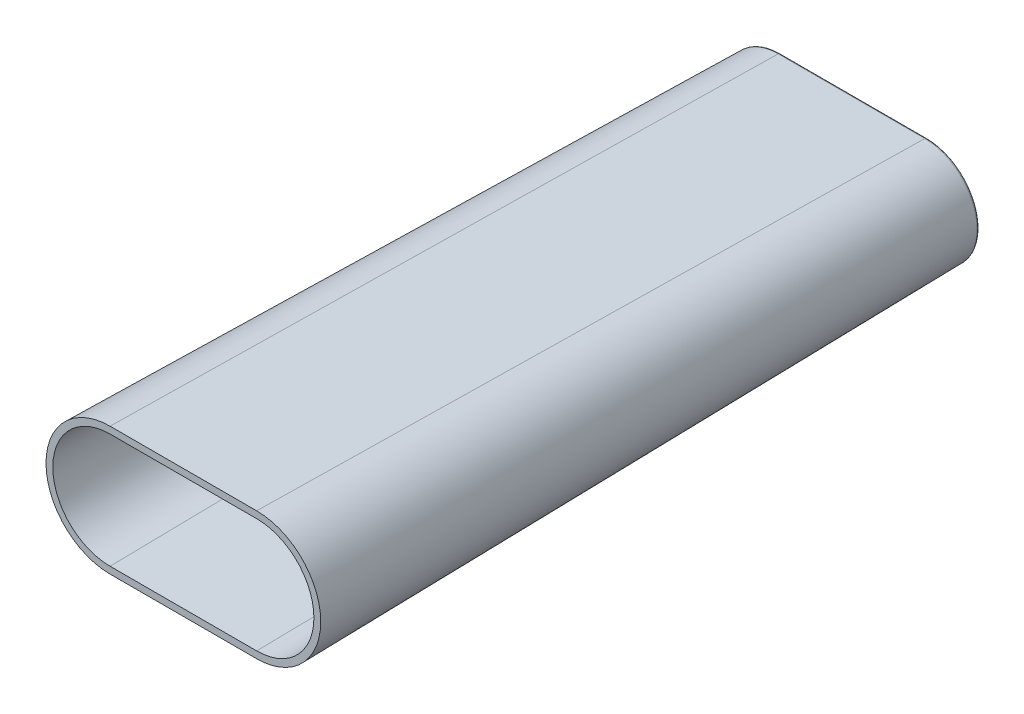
ISO-10303-21;
HEADER;
FILE_DESCRIPTION(('STEP AP214'),'2;1');
FILE_NAME('part.step','',(''),(''),'','','');
FILE_SCHEMA(('AUTOMOTIVE_DESIGN { 1 0 10303 214 1 1 1 1 }'));
ENDSEC;
DATA;
#1=APPLICATION_CONTEXT('core data for automotive mechanical design processes');
#2=APPLICATION_PROTOCOL_DEFINITION('international standard','automotive_design',2000,#1);
#3=PRODUCT_CONTEXT('',#1,'mechanical');
#4=PRODUCT('Part','Part','',(#3));
#5=PRODUCT_RELATED_PRODUCT_CATEGORY('part','',(#4));
#6=PRODUCT_DEFINITION_FORMATION('','',#4);
#7=PRODUCT_DEFINITION_CONTEXT('part definition',#1,'design');
#8=PRODUCT_DEFINITION('design','',#6,#7);
#9=PRODUCT_DEFINITION_SHAPE('','',#8);
#10=(LENGTH_UNIT() NAMED_UNIT(*) SI_UNIT(.MILLI.,.METRE.));
#11=(NAMED_UNIT(*) PLANE_ANGLE_UNIT() SI_UNIT($,.RADIAN.));
#12=(NAMED_UNIT(*) SI_UNIT($,.STERADIAN.) SOLID_ANGLE_UNIT());
#13=UNCERTAINTY_MEASURE_WITH_UNIT(LENGTH_MEASURE(1.E-05),#10,'distance_accuracy_value','');
#14=(GEOMETRIC_REPRESENTATION_CONTEXT(3) GLOBAL_UNCERTAINTY_ASSIGNED_CONTEXT((#13)) GLOBAL_UNIT_ASSIGNED_CONTEXT((#10,
#11,#12)) REPRESENTATION_CONTEXT('',''));
#15=CARTESIAN_POINT('',(0.,0.,0.));
#16=DIRECTION('',(0.,0.,1.));
#17=DIRECTION('',(1.,0.,0.));
#18=AXIS2_PLACEMENT_3D('',#15,#16,#17);
#19=CARTESIAN_POINT('',(-7.,-4.35009899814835,0.0113440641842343));
#20=DIRECTION('',(0.,-0.999847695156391,-0.0174524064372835));
#21=DIRECTION('',(0.,0.0174524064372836,-0.999847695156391));
#22=AXIS2_PLACEMENT_3D('',#19,#20,#21);
#23=PLANE('',#22);
#24=DIRECTION('',(-1.,0.,0.));
#25=VECTOR('',#24,1.);
#26=CARTESIAN_POINT('',(-0.500000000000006,-5.19896228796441,48.6426893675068));
#27=LINE('',#26,#25);
#28=CARTESIAN_POINT('',(-0.500000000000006,-5.19896228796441,48.6426893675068));
#29=VERTEX_POINT('',#28);
#30=CARTESIAN_POINT('',(0.499999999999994,-5.19896228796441,48.6426893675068));
#31=VERTEX_POINT('',#30);
#32=EDGE_CURVE('E168',#29,#31,#27,.F.);
#33=ORIENTED_EDGE('',*,*,#32,.F.);
#34=DIRECTION('',(0.,0.0174524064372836,-0.999847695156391));
#35=VECTOR('',#34,1.);
#36=CARTESIAN_POINT('',(-0.500000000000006,-5.21333156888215,49.4659049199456));
#37=LINE('',#36,#35);
#38=CARTESIAN_POINT('',(-0.5,-4.36124677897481,0.65));
#39=VERTEX_POINT('',#38);
#40=EDGE_CURVE('E169',#39,#29,#37,.F.);
#41=ORIENTED_EDGE('',*,*,#40,.F.);
#42=DIRECTION('',(-1.,0.,0.));
#43=VECTOR('',#42,1.);
#44=CARTESIAN_POINT('',(-7.,-4.3612467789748,0.65));
#45=LINE('',#44,#43);
#46=CARTESIAN_POINT('',(-7.,-4.3612467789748,0.65));
#47=VERTEX_POINT('',#46);
#48=EDGE_CURVE('E216',#47,#39,#45,.F.);
#49=ORIENTED_EDGE('',*,*,#48,.F.);
#50=DIRECTION('',(0.,0.0174524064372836,-0.999847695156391));
#51=VECTOR('',#50,1.);
#52=CARTESIAN_POINT('',(-7.,-4.35009899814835,0.0113440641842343));
#53=LINE('',#52,#51);
#54=CARTESIAN_POINT('',(-7.,-5.46702514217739,64.));
#55=VERTEX_POINT('',#54);
#56=EDGE_CURVE('E206',#55,#47,#53,.T.);
#57=ORIENTED_EDGE('',*,*,#56,.F.);
#58=DIRECTION('',(-1.,0.,0.));
#59=VECTOR('',#58,1.);
#60=CARTESIAN_POINT('',(-7.,-5.46702514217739,64.));
#61=LINE('',#60,#59);
#62=CARTESIAN_POINT('',(7.,-5.46702514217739,64.));
#63=VERTEX_POINT('',#62);
#64=EDGE_CURVE('E230',#55,#63,#61,.F.);
#65=ORIENTED_EDGE('',*,*,#64,.T.);
#66=DIRECTION('',(0.,-0.0174524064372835,0.999847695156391));
#67=VECTOR('',#66,1.);
#68=CARTESIAN_POINT('',(7.,-4.35009899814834,0.0113440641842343));
#69=LINE('',#68,#67);
#70=CARTESIAN_POINT('',(7.,-4.3612467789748,0.65));
#71=VERTEX_POINT('',#70);
#72=EDGE_CURVE('E210',#63,#71,#69,.F.);
#73=ORIENTED_EDGE('',*,*,#72,.T.);
#74=CARTESIAN_POINT('',(0.5,-4.3612467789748,0.65));
#75=VERTEX_POINT('',#74);
#76=EDGE_CURVE('E205',#75,#71,#45,.F.);
#77=ORIENTED_EDGE('',*,*,#76,.F.);
#78=DIRECTION('',(0.,-0.0174524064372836,0.999847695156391));
#79=VECTOR('',#78,1.);
#80=CARTESIAN_POINT('',(0.5,-4.3761263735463,1.50245140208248));
#81=LINE('',#80,#79);
#82=EDGE_CURVE('E51',#31,#75,#81,.F.);
#83=ORIENTED_EDGE('',*,*,#82,.F.);
#84=EDGE_LOOP('',(#33,#41,#49,#57,#65,#73,#77,#83));
#85=FACE_BOUND('',#84,.T.);
#86=ADVANCED_FACE('F34',(#85),#23,.F.);
#87=CARTESIAN_POINT('',(7.,4.35009899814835,0.0113440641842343));
#88=DIRECTION('',(0.,0.999847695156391,-0.0174524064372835));
#89=DIRECTION('',(0.,0.0174524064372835,0.999847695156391));
#90=AXIS2_PLACEMENT_3D('',#87,#88,#89);
#91=PLANE('',#90);
#92=DIRECTION('',(1.,0.,0.));
#93=VECTOR('',#92,1.);
#94=CARTESIAN_POINT('',(7.,4.3612467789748,0.65));
#95=LINE('',#94,#93);
#96=CARTESIAN_POINT('',(-0.5,4.3612467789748,0.65));
#97=VERTEX_POINT('',#96);
#98=CARTESIAN_POINT('',(-7.,4.3612467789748,0.65));
#99=VERTEX_POINT('',#98);
#100=EDGE_CURVE('E223',#97,#99,#95,.F.);
#101=ORIENTED_EDGE('',*,*,#100,.F.);
#102=DIRECTION('',(0.,-0.0174524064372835,-0.999847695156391));
#103=VECTOR('',#102,1.);
#104=CARTESIAN_POINT('',(-0.500000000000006,5.19896228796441,48.6426893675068));
#105=LINE('',#104,#103);
#106=CARTESIAN_POINT('',(-0.500000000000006,5.19896228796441,48.6426893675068));
#107=VERTEX_POINT('',#106);
#108=EDGE_CURVE('E182',#107,#97,#105,.T.);
#109=ORIENTED_EDGE('',*,*,#108,.F.);
#110=DIRECTION('',(-1.,0.,0.));
#111=VECTOR('',#110,1.);
#112=CARTESIAN_POINT('',(-0.500000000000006,5.19896228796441,48.6426893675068));
#113=LINE('',#112,#111);
#114=CARTESIAN_POINT('',(0.499999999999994,5.19896228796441,48.6426893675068));
#115=VERTEX_POINT('',#114);
#116=EDGE_CURVE('E165',#115,#107,#113,.T.);
#117=ORIENTED_EDGE('',*,*,#116,.F.);
#118=DIRECTION('',(0.,0.0174524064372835,0.999847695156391));
#119=VECTOR('',#118,1.);
#120=CARTESIAN_POINT('',(0.5,4.3612467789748,0.65));
#121=LINE('',#120,#119);
#122=CARTESIAN_POINT('',(0.5,4.3612467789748,0.65));
#123=VERTEX_POINT('',#122);
#124=EDGE_CURVE('E173',#123,#115,#121,.T.);
#125=ORIENTED_EDGE('',*,*,#124,.F.);
#126=CARTESIAN_POINT('',(7.,4.3612467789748,0.65));
#127=VERTEX_POINT('',#126);
#128=EDGE_CURVE('E226',#127,#123,#95,.F.);
#129=ORIENTED_EDGE('',*,*,#128,.F.);
#130=DIRECTION('',(0.,0.0174524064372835,0.999847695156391));
#131=VECTOR('',#130,1.);
#132=CARTESIAN_POINT('',(7.,4.35009899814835,0.0113440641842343));
#133=LINE('',#132,#131);
#134=CARTESIAN_POINT('',(7.,5.46702514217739,64.));
#135=VERTEX_POINT('',#134);
#136=EDGE_CURVE('E214',#135,#127,#133,.F.);
#137=ORIENTED_EDGE('',*,*,#136,.F.);
#138=DIRECTION('',(1.,0.,0.));
#139=VECTOR('',#138,1.);
#140=CARTESIAN_POINT('',(7.,5.46702514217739,64.));
#141=LINE('',#140,#139);
#142=CARTESIAN_POINT('',(-7.,5.46702514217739,64.));
#143=VERTEX_POINT('',#142);
#144=EDGE_CURVE('E215',#135,#143,#141,.F.);
#145=ORIENTED_EDGE('',*,*,#144,.T.);
#146=DIRECTION('',(0.,0.0174524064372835,0.999847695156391));
#147=VECTOR('',#146,1.);
#148=CARTESIAN_POINT('',(-7.,4.35009899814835,0.0113440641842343));
#149=LINE('',#148,#147);
#150=EDGE_CURVE('E211',#143,#99,#149,.F.);
#151=ORIENTED_EDGE('',*,*,#150,.T.);
#152=EDGE_LOOP('',(#101,#109,#117,#125,#129,#137,#145,#151));
#153=FACE_BOUND('',#152,.T.);
#154=ADVANCED_FACE('F181',(#153),#91,.F.);
#155=CARTESIAN_POINT('',(-7.,0.,0.65));
#156=DIRECTION('',(0.,0.,1.));
#157=DIRECTION('',(1.,0.,0.));
#158=AXIS2_PLACEMENT_3D('',#155,#156,#157);
#159=PLANE('',#158);
#160=ORIENTED_EDGE('',*,*,#48,.T.);
#161=DIRECTION('',(0.,1.,0.));
#162=VECTOR('',#161,1.);
#163=CARTESIAN_POINT('',(-0.5,-53.2130344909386,0.65));
#164=LINE('',#163,#162);
#165=EDGE_CURVE('E188',#39,#97,#164,.T.);
#166=ORIENTED_EDGE('',*,*,#165,.T.);
#167=ORIENTED_EDGE('',*,*,#100,.T.);
#168=CARTESIAN_POINT('',(-7.,0.,0.65));
#169=DIRECTION('',(0.,0.,1.));
#170=DIRECTION('',(1.,0.,0.));
#171=AXIS2_PLACEMENT_3D('',#168,#169,#170);
#172=CIRCLE('',#171,4.3612467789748);
#173=EDGE_CURVE('E202',#99,#47,#172,.T.);
#174=ORIENTED_EDGE('',*,*,#173,.T.);
#175=EDGE_LOOP('',(#160,#166,#167,#174));
#176=FACE_BOUND('',#175,.T.);
#177=ADVANCED_FACE('F338',(#176),#159,.T.);
#178=ORIENTED_EDGE('',*,*,#128,.T.);
#179=DIRECTION('',(0.,1.,0.));
#180=VECTOR('',#179,1.);
#181=CARTESIAN_POINT('',(0.5,-53.2130344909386,0.65));
#182=LINE('',#181,#180);
#183=EDGE_CURVE('E175',#75,#123,#182,.T.);
#184=ORIENTED_EDGE('',*,*,#183,.F.);
#185=ORIENTED_EDGE('',*,*,#76,.T.);
#186=CARTESIAN_POINT('',(7.,0.,0.65));
#187=DIRECTION('',(0.,0.,1.));
#188=DIRECTION('',(1.,0.,0.));
#189=AXIS2_PLACEMENT_3D('',#186,#187,#188);
#190=CIRCLE('',#189,4.3612467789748);
#191=EDGE_CURVE('E219',#71,#127,#190,.T.);
#192=ORIENTED_EDGE('',*,*,#191,.T.);
#193=EDGE_LOOP('',(#178,#184,#185,#192));
#194=FACE_BOUND('',#193,.T.);
#195=ADVANCED_FACE('F343',(#194),#159,.T.);
#196=CARTESIAN_POINT('',(-7.,0.,0.));
#197=DIRECTION('',(0.,0.,1.));
#198=DIRECTION('',(1.,0.,0.));
#199=AXIS2_PLACEMENT_3D('',#196,#197,#198);
#200=CONICAL_SURFACE('',#199,5.,0.0174532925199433);
#201=DIRECTION('',(0.,0.0174524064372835,0.999847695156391));
#202=VECTOR('',#201,1.);
#203=CARTESIAN_POINT('',(-7.,5.,0.));
#204=LINE('',#203,#202);
#205=CARTESIAN_POINT('',(-7.,6.11712415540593,64.));
#206=VERTEX_POINT('',#205);
#207=CARTESIAN_POINT('',(-7.,5.00343008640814,0.196509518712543));
#208=VERTEX_POINT('',#207);
#209=EDGE_CURVE('E244',#206,#208,#204,.F.);
#210=ORIENTED_EDGE('',*,*,#209,.T.);
#211=CARTESIAN_POINT('',(-7.,0.,0.196509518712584));
#212=DIRECTION('',(0.,0.,-1.));
#213=DIRECTION('',(-1.,0.,0.));
#214=AXIS2_PLACEMENT_3D('',#211,#212,#213);
#215=CIRCLE('',#214,5.00343008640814);
#216=CARTESIAN_POINT('',(-7.,-5.00343008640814,0.196509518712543));
#217=VERTEX_POINT('',#216);
#218=EDGE_CURVE('E12',#208,#217,#215,.F.);
#219=ORIENTED_EDGE('',*,*,#218,.T.);
#220=DIRECTION('',(0.,-0.0174524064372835,0.999847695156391));
#221=VECTOR('',#220,1.);
#222=CARTESIAN_POINT('',(-7.,-5.,0.));
#223=LINE('',#222,#221);
#224=CARTESIAN_POINT('',(-7.,-6.11712415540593,64.));
#225=VERTEX_POINT('',#224);
#226=EDGE_CURVE('E245',#225,#217,#223,.F.);
#227=ORIENTED_EDGE('',*,*,#226,.F.);
#228=CARTESIAN_POINT('',(-7.,0.,64.));
#229=DIRECTION('',(0.,0.,1.));
#230=DIRECTION('',(1.,0.,0.));
#231=AXIS2_PLACEMENT_3D('',#228,#229,#230);
#232=CIRCLE('',#231,6.11712415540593);
#233=EDGE_CURVE('E209',#206,#225,#232,.T.);
#234=ORIENTED_EDGE('',*,*,#233,.F.);
#235=EDGE_LOOP('',(#210,#219,#227,#234));
#236=FACE_BOUND('',#235,.T.);
#237=ADVANCED_FACE('F353',(#236),#200,.T.);
#238=CARTESIAN_POINT('',(-7.,-5.,0.));
#239=DIRECTION('',(0.,-0.999847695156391,-0.0174524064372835));
#240=DIRECTION('',(0.,0.0174524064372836,-0.999847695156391));
#241=AXIS2_PLACEMENT_3D('',#238,#239,#240);
#242=PLANE('',#241);
#243=ORIENTED_EDGE('',*,*,#226,.T.);
#244=DIRECTION('',(1.,0.,0.));
#245=VECTOR('',#244,1.);
#246=CARTESIAN_POINT('',(-7.,-5.00343008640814,0.196509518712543));
#247=LINE('',#246,#245);
#248=CARTESIAN_POINT('',(7.,-5.00343008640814,0.196509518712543));
#249=VERTEX_POINT('',#248);
#250=EDGE_CURVE('E248',#217,#249,#247,.T.);
#251=ORIENTED_EDGE('',*,*,#250,.T.);
#252=DIRECTION('',(0.,-0.0174524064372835,0.999847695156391));
#253=VECTOR('',#252,1.);
#254=CARTESIAN_POINT('',(7.,-5.,0.));
#255=LINE('',#254,#253);
#256=CARTESIAN_POINT('',(7.,-6.11712415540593,64.));
#257=VERTEX_POINT('',#256);
#258=EDGE_CURVE('E249',#257,#249,#255,.F.);
#259=ORIENTED_EDGE('',*,*,#258,.F.);
#260=DIRECTION('',(-1.,0.,0.));
#261=VECTOR('',#260,1.);
#262=CARTESIAN_POINT('',(-7.,-6.11712415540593,64.));
#263=LINE('',#262,#261);
#264=EDGE_CURVE('E238',#225,#257,#263,.F.);
#265=ORIENTED_EDGE('',*,*,#264,.F.);
#266=EDGE_LOOP('',(#243,#251,#259,#265));
#267=FACE_BOUND('',#266,.T.);
#268=ADVANCED_FACE('F356',(#267),#242,.T.);
#269=CARTESIAN_POINT('',(7.,0.,0.));
#270=DIRECTION('',(0.,0.,1.));
#271=DIRECTION('',(-1.,0.,0.));
#272=AXIS2_PLACEMENT_3D('',#269,#270,#271);
#273=CONICAL_SURFACE('',#272,5.,0.0174532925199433);
#274=ORIENTED_EDGE('',*,*,#258,.T.);
#275=CARTESIAN_POINT('',(7.,0.,0.196509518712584));
#276=DIRECTION('',(0.,0.,-1.));
#277=DIRECTION('',(-1.,0.,0.));
#278=AXIS2_PLACEMENT_3D('',#275,#276,#277);
#279=CIRCLE('',#278,5.00343008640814);
#280=CARTESIAN_POINT('',(7.,5.00343008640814,0.196509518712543));
#281=VERTEX_POINT('',#280);
#282=EDGE_CURVE('E275',#249,#281,#279,.F.);
#283=ORIENTED_EDGE('',*,*,#282,.T.);
#284=DIRECTION('',(0.,0.0174524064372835,0.999847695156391));
#285=VECTOR('',#284,1.);
#286=CARTESIAN_POINT('',(7.,5.,0.));
#287=LINE('',#286,#285);
#288=CARTESIAN_POINT('',(7.,6.11712415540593,64.));
#289=VERTEX_POINT('',#288);
#290=EDGE_CURVE('E251',#289,#281,#287,.F.);
#291=ORIENTED_EDGE('',*,*,#290,.F.);
#292=CARTESIAN_POINT('',(7.,0.,64.));
#293=DIRECTION('',(0.,0.,1.));
#294=DIRECTION('',(1.,0.,0.));
#295=AXIS2_PLACEMENT_3D('',#292,#293,#294);
#296=CIRCLE('',#295,6.11712415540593);
#297=EDGE_CURVE('E240',#257,#289,#296,.T.);
#298=ORIENTED_EDGE('',*,*,#297,.F.);
#299=EDGE_LOOP('',(#274,#283,#291,#298));
#300=FACE_BOUND('',#299,.T.);
#301=ADVANCED_FACE('F360',(#300),#273,.T.);
#302=CARTESIAN_POINT('',(7.,5.,0.));
#303=DIRECTION('',(0.,0.999847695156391,-0.0174524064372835));
#304=DIRECTION('',(0.,0.0174524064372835,0.999847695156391));
#305=AXIS2_PLACEMENT_3D('',#302,#303,#304);
#306=PLANE('',#305);
#307=ORIENTED_EDGE('',*,*,#290,.T.);
#308=DIRECTION('',(-1.,0.,0.));
#309=VECTOR('',#308,1.);
#310=CARTESIAN_POINT('',(7.,5.00343008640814,0.196509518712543));
#311=LINE('',#310,#309);
#312=EDGE_CURVE('E43',#281,#208,#311,.T.);
#313=ORIENTED_EDGE('',*,*,#312,.T.);
#314=ORIENTED_EDGE('',*,*,#209,.F.);
#315=DIRECTION('',(1.,0.,0.));
#316=VECTOR('',#315,1.);
#317=CARTESIAN_POINT('',(7.,6.11712415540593,64.));
#318=LINE('',#317,#316);
#319=EDGE_CURVE('E242',#289,#206,#318,.F.);
#320=ORIENTED_EDGE('',*,*,#319,.F.);
#321=EDGE_LOOP('',(#307,#313,#314,#320));
#322=FACE_BOUND('',#321,.T.);
#323=ADVANCED_FACE('F348',(#322),#306,.T.);
#324=CARTESIAN_POINT('',(-7.,0.,64.));
#325=DIRECTION('',(0.,0.,1.));
#326=DIRECTION('',(1.,0.,0.));
#327=AXIS2_PLACEMENT_3D('',#324,#325,#326);
#328=PLANE('',#327);
#329=CARTESIAN_POINT('',(-7.,0.,64.));
#330=DIRECTION('',(0.,0.,1.));
#331=DIRECTION('',(1.,0.,0.));
#332=AXIS2_PLACEMENT_3D('',#329,#330,#331);
#333=CIRCLE('',#332,5.46702514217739);
#334=EDGE_CURVE('E228',#143,#55,#333,.T.);
#335=ORIENTED_EDGE('',*,*,#334,.F.);
#336=ORIENTED_EDGE('',*,*,#144,.F.);
#337=CARTESIAN_POINT('',(7.,0.,64.));
#338=DIRECTION('',(0.,0.,1.));
#339=DIRECTION('',(1.,0.,0.));
#340=AXIS2_PLACEMENT_3D('',#337,#338,#339);
#341=CIRCLE('',#340,5.46702514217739);
#342=EDGE_CURVE('E232',#63,#135,#341,.T.);
#343=ORIENTED_EDGE('',*,*,#342,.F.);
#344=ORIENTED_EDGE('',*,*,#64,.F.);
#345=EDGE_LOOP('',(#335,#336,#343,#344));
#346=FACE_BOUND('',#345,.T.);
#347=ORIENTED_EDGE('',*,*,#233,.T.);
#348=ORIENTED_EDGE('',*,*,#264,.T.);
#349=ORIENTED_EDGE('',*,*,#297,.T.);
#350=ORIENTED_EDGE('',*,*,#319,.T.);
#351=EDGE_LOOP('',(#347,#348,#349,#350));
#352=FACE_BOUND('',#351,.T.);
#353=ADVANCED_FACE('F345',(#346,#352),#328,.T.);
#354=CARTESIAN_POINT('',(-7.,0.,0.));
#355=DIRECTION('',(0.,0.,1.));
#356=DIRECTION('',(1.,0.,0.));
#357=AXIS2_PLACEMENT_3D('',#354,#355,#356);
#358=PLANE('',#357);
#359=CARTESIAN_POINT('',(7.,0.,0.));
#360=DIRECTION('',(0.,0.,1.));
#361=DIRECTION('',(1.,0.,0.));
#362=AXIS2_PLACEMENT_3D('',#359,#360,#361);
#363=CIRCLE('',#362,4.80346054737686);
#364=CARTESIAN_POINT('',(7.,4.80346054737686,0.));
#365=VERTEX_POINT('',#364);
#366=CARTESIAN_POINT('',(7.,-4.80346054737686,0.));
#367=VERTEX_POINT('',#366);
#368=EDGE_CURVE('E270',#365,#367,#363,.F.);
#369=ORIENTED_EDGE('',*,*,#368,.T.);
#370=DIRECTION('',(-1.,0.,0.));
#371=VECTOR('',#370,1.);
#372=CARTESIAN_POINT('',(-7.,-4.80346054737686,0.));
#373=LINE('',#372,#371);
#374=CARTESIAN_POINT('',(-7.,-4.80346054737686,0.));
#375=VERTEX_POINT('',#374);
#376=EDGE_CURVE('E272',#367,#375,#373,.T.);
#377=ORIENTED_EDGE('',*,*,#376,.T.);
#378=CARTESIAN_POINT('',(-7.,0.,0.));
#379=DIRECTION('',(0.,0.,1.));
#380=DIRECTION('',(1.,0.,0.));
#381=AXIS2_PLACEMENT_3D('',#378,#379,#380);
#382=CIRCLE('',#381,4.80346054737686);
#383=CARTESIAN_POINT('',(-7.,4.80346054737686,0.));
#384=VERTEX_POINT('',#383);
#385=EDGE_CURVE('E266',#375,#384,#382,.F.);
#386=ORIENTED_EDGE('',*,*,#385,.T.);
#387=DIRECTION('',(1.,0.,0.));
#388=VECTOR('',#387,1.);
#389=CARTESIAN_POINT('',(-7.,4.80346054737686,0.));
#390=LINE('',#389,#388);
#391=EDGE_CURVE('E268',#384,#365,#390,.T.);
#392=ORIENTED_EDGE('',*,*,#391,.T.);
#393=EDGE_LOOP('',(#369,#377,#386,#392));
#394=FACE_BOUND('',#393,.T.);
#395=DIRECTION('',(-1.,0.,0.));
#396=VECTOR('',#395,1.);
#397=CARTESIAN_POINT('',(-7.,-3.7,0.));
#398=LINE('',#397,#396);
#399=CARTESIAN_POINT('',(-7.,-3.7,0.));
#400=VERTEX_POINT('',#399);
#401=CARTESIAN_POINT('',(7.,-3.7,0.));
#402=VERTEX_POINT('',#401);
#403=EDGE_CURVE('E261',#400,#402,#398,.F.);
#404=ORIENTED_EDGE('',*,*,#403,.T.);
#405=CARTESIAN_POINT('',(7.,0.,0.));
#406=DIRECTION('',(0.,0.,1.));
#407=DIRECTION('',(1.,0.,0.));
#408=AXIS2_PLACEMENT_3D('',#405,#406,#407);
#409=CIRCLE('',#408,3.7);
#410=CARTESIAN_POINT('',(7.,3.7,0.));
#411=VERTEX_POINT('',#410);
#412=EDGE_CURVE('E263',#402,#411,#409,.T.);
#413=ORIENTED_EDGE('',*,*,#412,.T.);
#414=DIRECTION('',(1.,0.,0.));
#415=VECTOR('',#414,1.);
#416=CARTESIAN_POINT('',(-7.,3.7,0.));
#417=LINE('',#416,#415);
#418=CARTESIAN_POINT('',(-7.,3.7,0.));
#419=VERTEX_POINT('',#418);
#420=EDGE_CURVE('E257',#411,#419,#417,.F.);
#421=ORIENTED_EDGE('',*,*,#420,.T.);
#422=CARTESIAN_POINT('',(-7.,0.,0.));
#423=DIRECTION('',(0.,0.,1.));
#424=DIRECTION('',(1.,0.,0.));
#425=AXIS2_PLACEMENT_3D('',#422,#423,#424);
#426=CIRCLE('',#425,3.7);
#427=EDGE_CURVE('E259',#419,#400,#426,.T.);
#428=ORIENTED_EDGE('',*,*,#427,.T.);
#429=EDGE_LOOP('',(#404,#413,#421,#428));
#430=FACE_BOUND('',#429,.T.);
#431=ADVANCED_FACE('F307',(#394,#430),#358,.F.);
#432=CARTESIAN_POINT('',(-7.,0.,0.0113440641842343));
#433=DIRECTION('',(0.,0.,1.));
#434=DIRECTION('',(1.,0.,0.));
#435=AXIS2_PLACEMENT_3D('',#432,#433,#434);
#436=CONICAL_SURFACE('',#435,4.35009899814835,0.0174532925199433);
#437=ORIENTED_EDGE('',*,*,#173,.F.);
#438=ORIENTED_EDGE('',*,*,#150,.F.);
#439=ORIENTED_EDGE('',*,*,#334,.T.);
#440=ORIENTED_EDGE('',*,*,#56,.T.);
#441=EDGE_LOOP('',(#437,#438,#439,#440));
#442=FACE_BOUND('',#441,.T.);
#443=ADVANCED_FACE('F327',(#442),#436,.F.);
#444=CARTESIAN_POINT('',(7.,0.,0.0113440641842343));
#445=DIRECTION('',(0.,0.,1.));
#446=DIRECTION('',(-1.,0.,0.));
#447=AXIS2_PLACEMENT_3D('',#444,#445,#446);
#448=CONICAL_SURFACE('',#447,4.35009899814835,0.0174532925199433);
#449=ORIENTED_EDGE('',*,*,#191,.F.);
#450=ORIENTED_EDGE('',*,*,#72,.F.);
#451=ORIENTED_EDGE('',*,*,#342,.T.);
#452=ORIENTED_EDGE('',*,*,#136,.T.);
#453=EDGE_LOOP('',(#449,#450,#451,#452));
#454=FACE_BOUND('',#453,.T.);
#455=ADVANCED_FACE('F318',(#454),#448,.F.);
#456=CARTESIAN_POINT('',(-7.,0.,0.2));
#457=DIRECTION('',(0.,0.,-1.));
#458=DIRECTION('',(0.,1.,0.));
#459=AXIS2_PLACEMENT_3D('',#456,#457,#458);
#460=PLANE('',#459);
#461=CARTESIAN_POINT('',(-7.,0.,0.2));
#462=DIRECTION('',(0.,0.,-1.));
#463=DIRECTION('',(0.,1.,0.));
#464=AXIS2_PLACEMENT_3D('',#461,#462,#463);
#465=CIRCLE('',#464,3.5);
#466=CARTESIAN_POINT('',(-7.,-3.5,0.2));
#467=VERTEX_POINT('',#466);
#468=CARTESIAN_POINT('',(-7.,3.5,0.2));
#469=VERTEX_POINT('',#468);
#470=EDGE_CURVE('E192',#467,#469,#465,.T.);
#471=ORIENTED_EDGE('',*,*,#470,.T.);
#472=DIRECTION('',(1.,0.,0.));
#473=VECTOR('',#472,1.);
#474=CARTESIAN_POINT('',(-7.,3.5,0.2));
#475=LINE('',#474,#473);
#476=CARTESIAN_POINT('',(7.,3.5,0.2));
#477=VERTEX_POINT('',#476);
#478=EDGE_CURVE('E194',#469,#477,#475,.T.);
#479=ORIENTED_EDGE('',*,*,#478,.T.);
#480=CARTESIAN_POINT('',(7.,0.,0.2));
#481=DIRECTION('',(0.,0.,-1.));
#482=DIRECTION('',(0.,1.,0.));
#483=AXIS2_PLACEMENT_3D('',#480,#481,#482);
#484=CIRCLE('',#483,3.5);
#485=CARTESIAN_POINT('',(7.,-3.5,0.2));
#486=VERTEX_POINT('',#485);
#487=EDGE_CURVE('E197',#477,#486,#484,.T.);
#488=ORIENTED_EDGE('',*,*,#487,.T.);
#489=DIRECTION('',(-1.,0.,0.));
#490=VECTOR('',#489,1.);
#491=CARTESIAN_POINT('',(7.,-3.5,0.2));
#492=LINE('',#491,#490);
#493=EDGE_CURVE('E200',#486,#467,#492,.T.);
#494=ORIENTED_EDGE('',*,*,#493,.T.);
#495=EDGE_LOOP('',(#471,#479,#488,#494));
#496=FACE_BOUND('',#495,.T.);
#497=ADVANCED_FACE('F315',(#496),#460,.T.);
#498=CARTESIAN_POINT('',(7.,4.80346054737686,0.2));
#499=DIRECTION('',(1.,0.,0.));
#500=DIRECTION('',(0.,0.,-1.));
#501=AXIS2_PLACEMENT_3D('',#498,#499,#500);
#502=CYLINDRICAL_SURFACE('',#501,0.2);
#503=CARTESIAN_POINT('',(7.,4.80346054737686,0.2));
#504=DIRECTION('',(1.,0.,0.));
#505=DIRECTION('',(0.,0.,-1.));
#506=AXIS2_PLACEMENT_3D('',#503,#504,#505);
#507=CIRCLE('',#506,0.2);
#508=EDGE_CURVE('E282',#365,#281,#507,.T.);
#509=ORIENTED_EDGE('',*,*,#508,.F.);
#510=ORIENTED_EDGE('',*,*,#391,.F.);
#511=CARTESIAN_POINT('',(-7.,4.80346054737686,0.2));
#512=DIRECTION('',(-1.,0.,0.));
#513=DIRECTION('',(0.,0.,1.));
#514=AXIS2_PLACEMENT_3D('',#511,#512,#513);
#515=CIRCLE('',#514,0.2);
#516=EDGE_CURVE('E195',#208,#384,#515,.T.);
#517=ORIENTED_EDGE('',*,*,#516,.F.);
#518=ORIENTED_EDGE('',*,*,#312,.F.);
#519=EDGE_LOOP('',(#509,#510,#517,#518));
#520=FACE_BOUND('',#519,.T.);
#521=ADVANCED_FACE('F317',(#520),#502,.T.);
#522=CARTESIAN_POINT('',(-7.,0.,0.2));
#523=DIRECTION('',(0.,0.,1.));
#524=DIRECTION('',(1.,0.,0.));
#525=AXIS2_PLACEMENT_3D('',#522,#523,#524);
#526=TOROIDAL_SURFACE('',#525,4.80346054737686,0.2);
#527=ORIENTED_EDGE('',*,*,#516,.T.);
#528=ORIENTED_EDGE('',*,*,#385,.F.);
#529=CARTESIAN_POINT('',(-7.,-4.80346054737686,0.2));
#530=DIRECTION('',(1.,0.,0.));
#531=DIRECTION('',(0.,0.,-1.));
#532=AXIS2_PLACEMENT_3D('',#529,#530,#531);
#533=CIRCLE('',#532,0.2);
#534=EDGE_CURVE('E280',#217,#375,#533,.T.);
#535=ORIENTED_EDGE('',*,*,#534,.F.);
#536=ORIENTED_EDGE('',*,*,#218,.F.);
#537=EDGE_LOOP('',(#527,#528,#535,#536));
#538=FACE_BOUND('',#537,.T.);
#539=ADVANCED_FACE('F324',(#538),#526,.T.);
#540=CARTESIAN_POINT('',(7.,0.,0.2));
#541=DIRECTION('',(0.,0.,1.));
#542=DIRECTION('',(1.,0.,0.));
#543=AXIS2_PLACEMENT_3D('',#540,#541,#542);
#544=TOROIDAL_SURFACE('',#543,4.80346054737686,0.2);
#545=ORIENTED_EDGE('',*,*,#508,.T.);
#546=ORIENTED_EDGE('',*,*,#282,.F.);
#547=CARTESIAN_POINT('',(7.,-4.80346054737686,0.2));
#548=DIRECTION('',(-1.,0.,0.));
#549=DIRECTION('',(0.,0.,1.));
#550=AXIS2_PLACEMENT_3D('',#547,#548,#549);
#551=CIRCLE('',#550,0.2);
#552=EDGE_CURVE('E278',#367,#249,#551,.T.);
#553=ORIENTED_EDGE('',*,*,#552,.F.);
#554=ORIENTED_EDGE('',*,*,#368,.F.);
#555=EDGE_LOOP('',(#545,#546,#553,#554));
#556=FACE_BOUND('',#555,.T.);
#557=ADVANCED_FACE('F370',(#556),#544,.T.);
#558=CARTESIAN_POINT('',(-7.,-4.80346054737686,0.2));
#559=DIRECTION('',(-1.,0.,0.));
#560=DIRECTION('',(0.,0.,1.));
#561=AXIS2_PLACEMENT_3D('',#558,#559,#560);
#562=CYLINDRICAL_SURFACE('',#561,0.2);
#563=ORIENTED_EDGE('',*,*,#534,.T.);
#564=ORIENTED_EDGE('',*,*,#376,.F.);
#565=ORIENTED_EDGE('',*,*,#552,.T.);
#566=ORIENTED_EDGE('',*,*,#250,.F.);
#567=EDGE_LOOP('',(#563,#564,#565,#566));
#568=FACE_BOUND('',#567,.T.);
#569=ADVANCED_FACE('F367',(#568),#562,.T.);
#570=CARTESIAN_POINT('',(-7.,0.,0.2));
#571=DIRECTION('',(0.,0.,1.));
#572=DIRECTION('',(1.,0.,0.));
#573=AXIS2_PLACEMENT_3D('',#570,#571,#572);
#574=TOROIDAL_SURFACE('',#573,3.7,0.2);
#575=CARTESIAN_POINT('',(-7.,-3.7,0.2));
#576=DIRECTION('',(1.,0.,0.));
#577=DIRECTION('',(0.,0.,-1.));
#578=AXIS2_PLACEMENT_3D('',#575,#576,#577);
#579=CIRCLE('',#578,0.2);
#580=EDGE_CURVE('E290',#400,#467,#579,.T.);
#581=ORIENTED_EDGE('',*,*,#580,.F.);
#582=ORIENTED_EDGE('',*,*,#427,.F.);
#583=CARTESIAN_POINT('',(-7.,3.7,0.2));
#584=DIRECTION('',(1.,0.,0.));
#585=DIRECTION('',(0.,0.,-1.));
#586=AXIS2_PLACEMENT_3D('',#583,#584,#585);
#587=CIRCLE('',#586,0.2);
#588=EDGE_CURVE('E38',#469,#419,#587,.T.);
#589=ORIENTED_EDGE('',*,*,#588,.F.);
#590=ORIENTED_EDGE('',*,*,#470,.F.);
#591=EDGE_LOOP('',(#581,#582,#589,#590));
#592=FACE_BOUND('',#591,.T.);
#593=ADVANCED_FACE('F36',(#592),#574,.T.);
#594=CARTESIAN_POINT('',(-7.,3.7,0.2));
#595=DIRECTION('',(1.,0.,0.));
#596=DIRECTION('',(0.,1.,0.));
#597=AXIS2_PLACEMENT_3D('',#594,#595,#596);
#598=CYLINDRICAL_SURFACE('',#597,0.2);
#599=ORIENTED_EDGE('',*,*,#588,.T.);
#600=ORIENTED_EDGE('',*,*,#420,.F.);
#601=CARTESIAN_POINT('',(7.,3.7,0.2));
#602=DIRECTION('',(1.,0.,0.));
#603=DIRECTION('',(0.,0.,-1.));
#604=AXIS2_PLACEMENT_3D('',#601,#602,#603);
#605=CIRCLE('',#604,0.2);
#606=EDGE_CURVE('E289',#477,#411,#605,.T.);
#607=ORIENTED_EDGE('',*,*,#606,.F.);
#608=ORIENTED_EDGE('',*,*,#478,.F.);
#609=EDGE_LOOP('',(#599,#600,#607,#608));
#610=FACE_BOUND('',#609,.T.);
#611=ADVANCED_FACE('F301',(#610),#598,.T.);
#612=CARTESIAN_POINT('',(7.,-3.7,0.2));
#613=DIRECTION('',(-1.,0.,0.));
#614=DIRECTION('',(0.,-1.,0.));
#615=AXIS2_PLACEMENT_3D('',#612,#613,#614);
#616=CYLINDRICAL_SURFACE('',#615,0.2);
#617=ORIENTED_EDGE('',*,*,#580,.T.);
#618=ORIENTED_EDGE('',*,*,#493,.F.);
#619=CARTESIAN_POINT('',(7.,-3.7,0.2));
#620=DIRECTION('',(1.,0.,0.));
#621=DIRECTION('',(0.,0.,-1.));
#622=AXIS2_PLACEMENT_3D('',#619,#620,#621);
#623=CIRCLE('',#622,0.2);
#624=EDGE_CURVE('E287',#402,#486,#623,.T.);
#625=ORIENTED_EDGE('',*,*,#624,.F.);
#626=ORIENTED_EDGE('',*,*,#403,.F.);
#627=EDGE_LOOP('',(#617,#618,#625,#626));
#628=FACE_BOUND('',#627,.T.);
#629=ADVANCED_FACE('F313',(#628),#616,.T.);
#630=CARTESIAN_POINT('',(7.,0.,0.2));
#631=DIRECTION('',(0.,0.,1.));
#632=DIRECTION('',(1.,0.,0.));
#633=AXIS2_PLACEMENT_3D('',#630,#631,#632);
#634=TOROIDAL_SURFACE('',#633,3.7,0.2);
#635=ORIENTED_EDGE('',*,*,#606,.T.);
#636=ORIENTED_EDGE('',*,*,#412,.F.);
#637=ORIENTED_EDGE('',*,*,#624,.T.);
#638=ORIENTED_EDGE('',*,*,#487,.F.);
#639=EDGE_LOOP('',(#635,#636,#637,#638));
#640=FACE_BOUND('',#639,.T.);
#641=ADVANCED_FACE('F311',(#640),#634,.T.);
#642=CARTESIAN_POINT('',(-0.500000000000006,-52.375318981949,48.6426893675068));
#643=DIRECTION('',(1.,0.,0.));
#644=DIRECTION('',(0.,0.,-1.));
#645=AXIS2_PLACEMENT_3D('',#642,#643,#644);
#646=PLANE('',#645);
#647=ORIENTED_EDGE('',*,*,#165,.F.);
#648=ORIENTED_EDGE('',*,*,#40,.T.);
#649=DIRECTION('',(0.,1.,0.));
#650=VECTOR('',#649,1.);
#651=CARTESIAN_POINT('',(-0.500000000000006,-52.375318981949,48.6426893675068));
#652=LINE('',#651,#650);
#653=EDGE_CURVE('E170',#29,#107,#652,.T.);
#654=ORIENTED_EDGE('',*,*,#653,.T.);
#655=ORIENTED_EDGE('',*,*,#108,.T.);
#656=EDGE_LOOP('',(#647,#648,#654,#655));
#657=FACE_BOUND('',#656,.T.);
#658=ADVANCED_FACE('F380',(#657),#646,.F.);
#659=CARTESIAN_POINT('',(-0.500000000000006,-52.375318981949,48.6426893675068));
#660=DIRECTION('',(0.,0.,-1.));
#661=DIRECTION('',(-1.,0.,0.));
#662=AXIS2_PLACEMENT_3D('',#659,#660,#661);
#663=PLANE('',#662);
#664=ORIENTED_EDGE('',*,*,#653,.F.);
#665=ORIENTED_EDGE('',*,*,#32,.T.);
#666=DIRECTION('',(0.,1.,0.));
#667=VECTOR('',#666,1.);
#668=CARTESIAN_POINT('',(0.499999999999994,-52.375318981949,48.6426893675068));
#669=LINE('',#668,#667);
#670=EDGE_CURVE('E161',#31,#115,#669,.T.);
#671=ORIENTED_EDGE('',*,*,#670,.T.);
#672=ORIENTED_EDGE('',*,*,#116,.T.);
#673=EDGE_LOOP('',(#664,#665,#671,#672));
#674=FACE_BOUND('',#673,.T.);
#675=ADVANCED_FACE('F163',(#674),#663,.F.);
#676=CARTESIAN_POINT('',(0.5,-53.2130344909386,0.65));
#677=DIRECTION('',(-1.,0.,0.));
#678=DIRECTION('',(0.,0.,1.));
#679=AXIS2_PLACEMENT_3D('',#676,#677,#678);
#680=PLANE('',#679);
#681=ORIENTED_EDGE('',*,*,#670,.F.);
#682=ORIENTED_EDGE('',*,*,#82,.T.);
#683=ORIENTED_EDGE('',*,*,#183,.T.);
#684=ORIENTED_EDGE('',*,*,#124,.T.);
#685=EDGE_LOOP('',(#681,#682,#683,#684));
#686=FACE_BOUND('',#685,.T.);
#687=ADVANCED_FACE('F174',(#686),#680,.F.);
#688=CLOSED_SHELL('',(#86,#154,#177,#195,#237,#268,#301,#323,#353,#431,#443,#455,#497,#521,#539,
#557,#569,#593,#611,#629,#641,#658,#675,#687));
#689=MANIFOLD_SOLID_BREP('B2',#688);
#690=ADVANCED_BREP_SHAPE_REPRESENTATION('',(#18,#689),#14);
#691=SHAPE_DEFINITION_REPRESENTATION(#9,#690);
ENDSEC;
END-ISO-10303-21;
